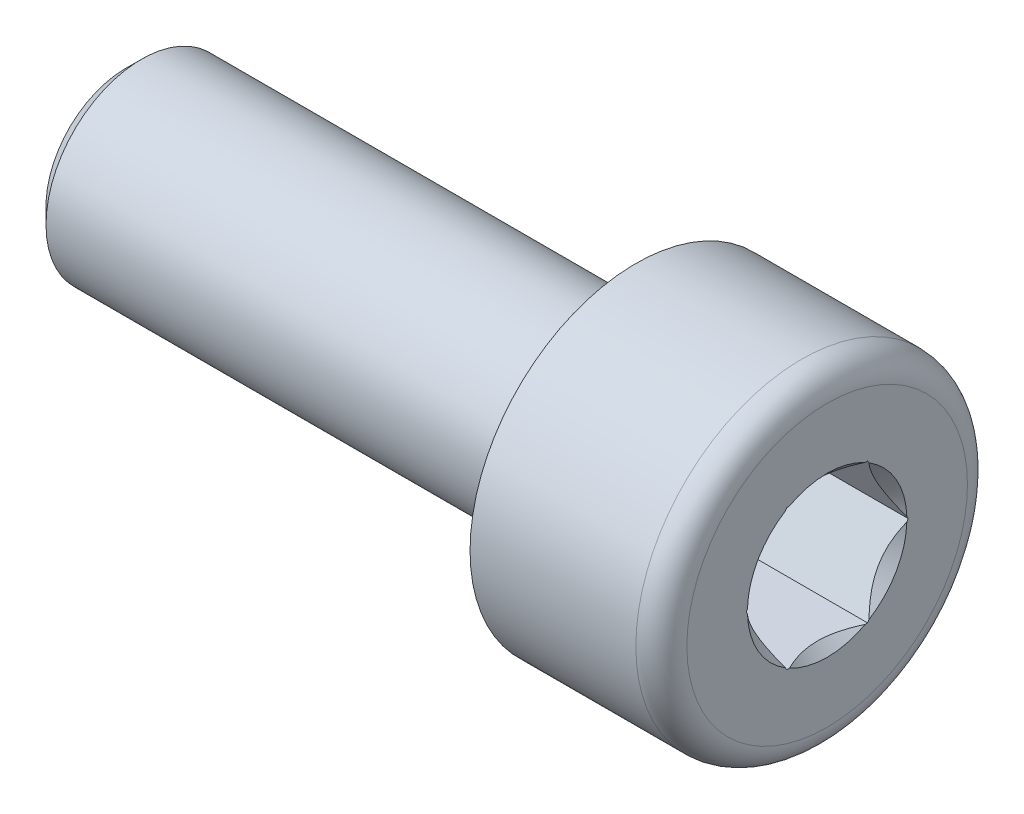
ISO-10303-21;
HEADER;
FILE_DESCRIPTION(('STEP AP214'),'2;1');
FILE_NAME('part.step','',(''),(''),'','','');
FILE_SCHEMA(('AUTOMOTIVE_DESIGN { 1 0 10303 214 1 1 1 1 }'));
ENDSEC;
DATA;
#1=APPLICATION_CONTEXT('core data for automotive mechanical design processes');
#2=APPLICATION_PROTOCOL_DEFINITION('international standard','automotive_design',2000,#1);
#3=PRODUCT_CONTEXT('',#1,'mechanical');
#4=PRODUCT('Part','Part','',(#3));
#5=PRODUCT_RELATED_PRODUCT_CATEGORY('part','',(#4));
#6=PRODUCT_DEFINITION_FORMATION('','',#4);
#7=PRODUCT_DEFINITION_CONTEXT('part definition',#1,'design');
#8=PRODUCT_DEFINITION('design','',#6,#7);
#9=PRODUCT_DEFINITION_SHAPE('','',#8);
#10=(LENGTH_UNIT() NAMED_UNIT(*) SI_UNIT(.MILLI.,.METRE.));
#11=(NAMED_UNIT(*) PLANE_ANGLE_UNIT() SI_UNIT($,.RADIAN.));
#12=(NAMED_UNIT(*) SI_UNIT($,.STERADIAN.) SOLID_ANGLE_UNIT());
#13=UNCERTAINTY_MEASURE_WITH_UNIT(LENGTH_MEASURE(1.E-05),#10,'distance_accuracy_value','');
#14=(GEOMETRIC_REPRESENTATION_CONTEXT(3) GLOBAL_UNCERTAINTY_ASSIGNED_CONTEXT((#13)) GLOBAL_UNIT_ASSIGNED_CONTEXT((#10,
#11,#12)) REPRESENTATION_CONTEXT('',''));
#15=CARTESIAN_POINT('',(0.,0.,0.));
#16=DIRECTION('',(0.,0.,1.));
#17=DIRECTION('',(1.,0.,0.));
#18=AXIS2_PLACEMENT_3D('',#15,#16,#17);
#19=CARTESIAN_POINT('',(2.75,0.,0.));
#20=DIRECTION('',(1.,0.,0.));
#21=DIRECTION('',(0.,0.,-1.));
#22=AXIS2_PLACEMENT_3D('',#19,#20,#21);
#23=CONICAL_SURFACE('',#22,1.,0.785398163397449);
#24=CARTESIAN_POINT('',(3.,0.,0.));
#25=DIRECTION('',(-1.,0.,0.));
#26=DIRECTION('',(0.,0.,1.));
#27=AXIS2_PLACEMENT_3D('',#24,#25,#26);
#28=CIRCLE('',#27,1.25);
#29=CARTESIAN_POINT('',(3.,0.0358259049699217,1.24948649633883));
#30=VERTEX_POINT('',#29);
#31=CARTESIAN_POINT('',(3.,1.06417409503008,0.655769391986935));
#32=VERTEX_POINT('',#31);
#33=EDGE_CURVE('E564',#30,#32,#28,.T.);
#34=ORIENTED_EDGE('',*,*,#33,.F.);
#35=CARTESIAN_POINT('',(3.0002,0.0354613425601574,1.24969697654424));
#36=CARTESIAN_POINT('',(2.98057106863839,0.0712525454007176,1.22903291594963));
#37=CARTESIAN_POINT('',(2.96218791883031,0.107621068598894,1.20803553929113));
#38=CARTESIAN_POINT('',(2.92869924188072,0.181665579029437,1.16528592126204));
#39=CARTESIAN_POINT('',(2.9136099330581,0.219347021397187,1.14353053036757));
#40=CARTESIAN_POINT('',(2.8878781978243,0.295301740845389,1.09967805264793));
#41=CARTESIAN_POINT('',(2.87717776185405,0.333559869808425,1.07758971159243));
#42=CARTESIAN_POINT('',(2.86081733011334,0.410818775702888,1.03298426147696));
#43=CARTESIAN_POINT('',(2.85514691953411,0.449817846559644,1.01046813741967));
#44=CARTESIAN_POINT('',(2.8500562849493,0.518738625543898,0.970676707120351));
#45=CARTESIAN_POINT('',(2.84946433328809,0.548597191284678,0.953437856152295));
#46=CARTESIAN_POINT('',(2.85151417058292,0.608233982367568,0.919006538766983));
#47=CARTESIAN_POINT('',(2.85415683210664,0.638012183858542,0.901814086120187));
#48=CARTESIAN_POINT('',(2.86675061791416,0.726876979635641,0.850507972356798));
#49=CARTESIAN_POINT('',(2.8813674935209,0.785494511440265,0.816665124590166));
#50=CARTESIAN_POINT('',(2.91371510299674,0.880953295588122,0.761551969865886));
#51=CARTESIAN_POINT('',(2.92877855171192,0.918533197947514,0.739855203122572));
#52=CARTESIAN_POINT('',(2.9622229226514,0.992432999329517,0.697189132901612));
#53=CARTESIAN_POINT('',(2.98059247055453,1.0287567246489,0.676217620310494));
#54=CARTESIAN_POINT('',(3.00020000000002,1.06453865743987,0.655558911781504));
#55=B_SPLINE_CURVE_WITH_KNOTS('',3,(#35,#36,#37,#38,#39,#40,#41,#42,#43,#44,#45,#46,#47,#48,#49,
#50,#51,#52,#53,#54),.UNSPECIFIED.,.F.,.F.,(4,2,2,2,2,2,2,2,2,4),(0.,0.137339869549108,
0.275341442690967,0.411455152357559,0.547286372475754,0.650583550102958,0.7539085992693,
0.960556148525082,1.09823708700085,1.23545309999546),.UNSPECIFIED.);
#56=EDGE_CURVE('E535',#30,#32,#55,.T.);
#57=ORIENTED_EDGE('',*,*,#56,.T.);
#58=EDGE_LOOP('',(#34,#57));
#59=FACE_BOUND('',#58,.T.);
#60=ADVANCED_FACE('F348',(#59),#23,.F.);
#61=CARTESIAN_POINT('',(3.,1.1,0.593717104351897));
#62=VERTEX_POINT('',#61);
#63=CARTESIAN_POINT('',(3.,1.1,-0.593717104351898));
#64=VERTEX_POINT('',#63);
#65=EDGE_CURVE('E567',#62,#64,#28,.T.);
#66=ORIENTED_EDGE('',*,*,#65,.F.);
#67=CARTESIAN_POINT('',(3.43571423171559,1.1,-1.27735369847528));
#68=CARTESIAN_POINT('',(3.41218595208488,1.1,-1.24629889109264));
#69=CARTESIAN_POINT('',(3.38888516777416,1.1,-1.2150722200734));
#70=CARTESIAN_POINT('',(3.34283288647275,1.1,-1.1522050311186));
#71=CARTESIAN_POINT('',(3.32008152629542,1.1,-1.12056441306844));
#72=CARTESIAN_POINT('',(3.2524682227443,1.1,-1.02445312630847));
#73=CARTESIAN_POINT('',(3.20860927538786,1.1,-0.959265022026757));
#74=CARTESIAN_POINT('',(3.12241005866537,1.1,-0.822498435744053));
#75=CARTESIAN_POINT('',(3.08030683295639,1.1,-0.750768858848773));
#76=CARTESIAN_POINT('',(3.00322214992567,1.1,-0.60371335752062));
#77=CARTESIAN_POINT('',(2.96821667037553,1.1,-0.52840066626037));
#78=CARTESIAN_POINT('',(2.92538751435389,1.1,-0.415458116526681));
#79=CARTESIAN_POINT('',(2.91311338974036,1.1,-0.379523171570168));
#80=CARTESIAN_POINT('',(2.89144883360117,1.1,-0.306776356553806));
#81=CARTESIAN_POINT('',(2.8820585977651,1.1,-0.269964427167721));
#82=CARTESIAN_POINT('',(2.86681026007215,1.1,-0.196309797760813));
#83=CARTESIAN_POINT('',(2.8608904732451,1.1,-0.15948007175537));
#84=CARTESIAN_POINT('',(2.85269658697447,1.1,-0.0854029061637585));
#85=CARTESIAN_POINT('',(2.85042301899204,1.1,-0.0481554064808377));
#86=CARTESIAN_POINT('',(2.84969862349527,1.1,0.0249787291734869));
#87=CARTESIAN_POINT('',(2.8511076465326,1.1,0.0608640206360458));
#88=CARTESIAN_POINT('',(2.85735793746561,1.1,0.132320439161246));
#89=CARTESIAN_POINT('',(2.86219840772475,1.1,0.167891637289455));
#90=CARTESIAN_POINT('',(2.87512760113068,1.1,0.239082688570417));
#91=CARTESIAN_POINT('',(2.8832724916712,1.1,0.274692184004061));
#92=CARTESIAN_POINT('',(2.90237439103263,1.1,0.345131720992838));
#93=CARTESIAN_POINT('',(2.91333117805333,1.1,0.379961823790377));
#94=CARTESIAN_POINT('',(2.95180952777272,1.1,0.489135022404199));
#95=CARTESIAN_POINT('',(2.98369310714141,1.1,0.561936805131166));
#96=CARTESIAN_POINT('',(3.05459595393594,1.1,0.704124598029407));
#97=CARTESIAN_POINT('',(3.09364075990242,1.1,0.773497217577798));
#98=CARTESIAN_POINT('',(3.17420835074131,1.1,0.90608520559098));
#99=CARTESIAN_POINT('',(3.21551216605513,1.1,0.969435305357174));
#100=CARTESIAN_POINT('',(3.2793699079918,1.1,1.06276872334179));
#101=CARTESIAN_POINT('',(3.30088220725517,1.1,1.09347730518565));
#102=CARTESIAN_POINT('',(3.34447743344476,1.1,1.15447448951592));
#103=CARTESIAN_POINT('',(3.36656020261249,1.1,1.18476320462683));
#104=CARTESIAN_POINT('',(3.38887955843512,1.1,1.21487703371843));
#105=B_SPLINE_CURVE_WITH_KNOTS('',3,(#67,#68,#69,#70,#71,#72,#73,#74,#75,#76,#77,#78,#79,#80,
#81,#82,#83,#84,#85,#86,#87,#88,#89,#90,#91,#92,#93,#94,#95,#96,#97,#98,#99,#100,#101,#102,#103,
#104),.UNSPECIFIED.,.F.,.F.,(4,2,2,2,2,2,2,2,2,2,2,2,2,2,2,2,2,2,4),(0.,0.116880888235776,
0.233790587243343,0.469393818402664,0.718712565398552,0.967172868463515,1.08099679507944,
1.19482844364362,1.30657013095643,1.41832810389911,1.52589533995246,1.63343758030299,
1.74288995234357,1.85233369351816,2.09006749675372,2.32866620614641,2.5554302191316,
2.66790773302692,2.78035446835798),.UNSPECIFIED.);
#106=EDGE_CURVE('E543',#62,#64,#105,.F.);
#107=ORIENTED_EDGE('',*,*,#106,.T.);
#108=EDGE_LOOP('',(#66,#107));
#109=FACE_BOUND('',#108,.T.);
#110=ADVANCED_FACE('F608',(#109),#23,.F.);
#111=CARTESIAN_POINT('',(3.,1.06417409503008,-0.655769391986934));
#112=VERTEX_POINT('',#111);
#113=CARTESIAN_POINT('',(3.,0.0358259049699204,-1.24948649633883));
#114=VERTEX_POINT('',#113);
#115=EDGE_CURVE('E583',#112,#114,#28,.T.);
#116=ORIENTED_EDGE('',*,*,#115,.F.);
#117=CARTESIAN_POINT('',(3.00020000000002,1.06453865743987,-0.655558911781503));
#118=CARTESIAN_POINT('',(2.9805710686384,1.02874745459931,-0.676222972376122));
#119=CARTESIAN_POINT('',(2.96218791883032,0.992378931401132,-0.69722034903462));
#120=CARTESIAN_POINT('',(2.92869924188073,0.918334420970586,-0.739969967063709));
#121=CARTESIAN_POINT('',(2.91360993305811,0.880652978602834,-0.761725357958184));
#122=CARTESIAN_POINT('',(2.8878781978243,0.804698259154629,-0.805577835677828));
#123=CARTESIAN_POINT('',(2.87717776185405,0.766440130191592,-0.827666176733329));
#124=CARTESIAN_POINT('',(2.86081733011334,0.689181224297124,-0.872271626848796));
#125=CARTESIAN_POINT('',(2.85514691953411,0.650182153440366,-0.894787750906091));
#126=CARTESIAN_POINT('',(2.8500562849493,0.58126137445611,-0.934579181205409));
#127=CARTESIAN_POINT('',(2.84946433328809,0.55140280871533,-0.951818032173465));
#128=CARTESIAN_POINT('',(2.85151417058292,0.49176601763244,-0.986249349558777));
#129=CARTESIAN_POINT('',(2.85415683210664,0.461987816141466,-1.00344180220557));
#130=CARTESIAN_POINT('',(2.86675061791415,0.373123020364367,-1.05474791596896));
#131=CARTESIAN_POINT('',(2.88136749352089,0.314505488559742,-1.08859076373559));
#132=CARTESIAN_POINT('',(2.91371510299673,0.219046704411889,-1.14370391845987));
#133=CARTESIAN_POINT('',(2.92877855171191,0.181466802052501,-1.16540068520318));
#134=CARTESIAN_POINT('',(2.96222292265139,0.107567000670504,-1.20806675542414));
#135=CARTESIAN_POINT('',(2.98059247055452,0.0712432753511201,-1.22903826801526));
#136=CARTESIAN_POINT('',(3.0002,0.0354613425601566,-1.24969697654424));
#137=B_SPLINE_CURVE_WITH_KNOTS('',3,(#117,#118,#119,#120,#121,#122,#123,#124,#125,#126,#127,
#128,#129,#130,#131,#132,#133,#134,#135,#136),.UNSPECIFIED.,.F.,.F.,(4,2,2,2,2,2,2,2,2,4),(0.,
0.137339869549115,0.275341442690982,0.41145515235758,0.547286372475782,0.650583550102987,
0.753908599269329,0.960556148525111,1.09823708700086,1.23545309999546),.UNSPECIFIED.);
#138=EDGE_CURVE('E589',#112,#114,#137,.T.);
#139=ORIENTED_EDGE('',*,*,#138,.T.);
#140=EDGE_LOOP('',(#116,#139));
#141=FACE_BOUND('',#140,.T.);
#142=ADVANCED_FACE('F588',(#141),#23,.F.);
#143=CARTESIAN_POINT('',(3.,-0.0358259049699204,-1.24948649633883));
#144=VERTEX_POINT('',#143);
#145=CARTESIAN_POINT('',(3.,-1.06417409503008,-0.655769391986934));
#146=VERTEX_POINT('',#145);
#147=EDGE_CURVE('E590',#144,#146,#28,.T.);
#148=ORIENTED_EDGE('',*,*,#147,.F.);
#149=CARTESIAN_POINT('',(3.0002,-0.0354613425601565,-1.24969697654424));
#150=CARTESIAN_POINT('',(2.98057106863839,-0.0712525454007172,-1.22903291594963));
#151=CARTESIAN_POINT('',(2.96218791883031,-0.107621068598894,-1.20803553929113));
#152=CARTESIAN_POINT('',(2.92869924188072,-0.181665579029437,-1.16528592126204));
#153=CARTESIAN_POINT('',(2.9136099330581,-0.219347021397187,-1.14353053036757));
#154=CARTESIAN_POINT('',(2.88787819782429,-0.295301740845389,-1.09967805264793));
#155=CARTESIAN_POINT('',(2.87717776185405,-0.333559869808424,-1.07758971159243));
#156=CARTESIAN_POINT('',(2.86081733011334,-0.410818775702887,-1.03298426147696));
#157=CARTESIAN_POINT('',(2.85514691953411,-0.449817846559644,-1.01046813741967));
#158=CARTESIAN_POINT('',(2.8500562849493,-0.518738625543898,-0.97067670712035));
#159=CARTESIAN_POINT('',(2.84946433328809,-0.548597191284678,-0.953437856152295));
#160=CARTESIAN_POINT('',(2.85151417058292,-0.608233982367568,-0.919006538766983));
#161=CARTESIAN_POINT('',(2.85415683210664,-0.638012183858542,-0.901814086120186));
#162=CARTESIAN_POINT('',(2.86675061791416,-0.72687697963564,-0.850507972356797));
#163=CARTESIAN_POINT('',(2.8813674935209,-0.785494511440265,-0.816665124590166));
#164=CARTESIAN_POINT('',(2.91371510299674,-0.880953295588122,-0.761551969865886));
#165=CARTESIAN_POINT('',(2.92877855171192,-0.918533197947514,-0.739855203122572));
#166=CARTESIAN_POINT('',(2.9622229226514,-0.992432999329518,-0.697189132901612));
#167=CARTESIAN_POINT('',(2.98059247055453,-1.02875672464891,-0.676217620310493));
#168=CARTESIAN_POINT('',(3.00020000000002,-1.06453865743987,-0.655558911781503));
#169=B_SPLINE_CURVE_WITH_KNOTS('',3,(#149,#150,#151,#152,#153,#154,#155,#156,#157,#158,#159,
#160,#161,#162,#163,#164,#165,#166,#167,#168),.UNSPECIFIED.,.F.,.F.,(4,2,2,2,2,2,2,2,2,4),(0.,
0.137339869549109,0.275341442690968,0.41145515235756,0.547286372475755,0.650583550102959,
0.753908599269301,0.960556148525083,1.09823708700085,1.23545309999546),.UNSPECIFIED.);
#170=EDGE_CURVE('E620',#144,#146,#169,.T.);
#171=ORIENTED_EDGE('',*,*,#170,.T.);
#172=EDGE_LOOP('',(#148,#171));
#173=FACE_BOUND('',#172,.T.);
#174=ADVANCED_FACE('F611',(#173),#23,.F.);
#175=CARTESIAN_POINT('',(3.,-1.1,-0.593717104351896));
#176=VERTEX_POINT('',#175);
#177=CARTESIAN_POINT('',(3.,-1.1,0.593717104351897));
#178=VERTEX_POINT('',#177);
#179=EDGE_CURVE('E463',#176,#178,#28,.T.);
#180=ORIENTED_EDGE('',*,*,#179,.F.);
#181=CARTESIAN_POINT('',(3.43571423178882,-1.1,-1.27735369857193));
#182=CARTESIAN_POINT('',(3.41218595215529,-1.1,-1.24629889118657));
#183=CARTESIAN_POINT('',(3.38888516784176,-1.1,-1.21507222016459));
#184=CARTESIAN_POINT('',(3.34283288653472,-1.1,-1.15220503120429));
#185=CARTESIAN_POINT('',(3.32008152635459,-1.1,-1.12056441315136));
#186=CARTESIAN_POINT('',(3.25246822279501,-1.1,-1.02445312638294));
#187=CARTESIAN_POINT('',(3.20860927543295,-1.1,-0.95926502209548));
#188=CARTESIAN_POINT('',(3.1224100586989,-1.1,-0.822498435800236));
#189=CARTESIAN_POINT('',(3.08030683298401,-1.1,-0.750768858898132));
#190=CARTESIAN_POINT('',(3.00322214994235,-1.1,-0.603713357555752));
#191=CARTESIAN_POINT('',(2.96821667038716,-1.1,-0.528400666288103));
#192=CARTESIAN_POINT('',(2.92538751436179,-1.1,-0.415458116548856));
#193=CARTESIAN_POINT('',(2.91311338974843,-1.1,-0.379523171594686));
#194=CARTESIAN_POINT('',(2.89144883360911,-1.1,-0.30677635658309));
#195=CARTESIAN_POINT('',(2.88205859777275,-1.1,-0.269964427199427));
#196=CARTESIAN_POINT('',(2.86681026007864,-1.1,-0.196309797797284));
#197=CARTESIAN_POINT('',(2.86089047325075,-1.1,-0.159480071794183));
#198=CARTESIAN_POINT('',(2.85269658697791,-1.1,-0.0854029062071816));
#199=CARTESIAN_POINT('',(2.85042301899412,-1.1,-0.0481554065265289));
#200=CARTESIAN_POINT('',(2.8496986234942,-1.1,0.0249787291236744));
#201=CARTESIAN_POINT('',(2.8511076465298,-1.1,0.060864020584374));
#202=CARTESIAN_POINT('',(2.85735793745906,-1.1,0.132320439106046));
#203=CARTESIAN_POINT('',(2.86219840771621,-1.1,0.167891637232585));
#204=CARTESIAN_POINT('',(2.87512760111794,-1.1,0.239082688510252));
#205=CARTESIAN_POINT('',(2.88327249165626,-1.1,0.274692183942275));
#206=CARTESIAN_POINT('',(2.90237439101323,-1.1,0.34513172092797));
#207=CARTESIAN_POINT('',(2.91333117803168,-1.1,0.379961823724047));
#208=CARTESIAN_POINT('',(2.9518095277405,-1.1,0.489135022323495));
#209=CARTESIAN_POINT('',(2.98369310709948,-1.1,0.561936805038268));
#210=CARTESIAN_POINT('',(3.0545959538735,-1.1,0.70412459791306));
#211=CARTESIAN_POINT('',(3.09364075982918,-1.1,0.7734972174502));
#212=CARTESIAN_POINT('',(3.17420835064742,-1.1,0.90608520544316));
#213=CARTESIAN_POINT('',(3.21551216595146,-1.1,0.969435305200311));
#214=CARTESIAN_POINT('',(3.27936990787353,-1.1,1.06276872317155));
#215=CARTESIAN_POINT('',(3.30088220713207,-1.1,1.09347730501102));
#216=CARTESIAN_POINT('',(3.344477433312,-1.1,1.15447448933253));
#217=CARTESIAN_POINT('',(3.3665602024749,-1.1,1.18476320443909));
#218=CARTESIAN_POINT('',(3.38887955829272,-1.1,1.21487703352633));
#219=B_SPLINE_CURVE_WITH_KNOTS('',3,(#181,#182,#183,#184,#185,#186,#187,#188,#189,#190,#191,
#192,#193,#194,#195,#196,#197,#198,#199,#200,#201,#202,#203,#204,#205,#206,#207,#208,#209,#210,
#211,#212,#213,#214,#215,#216,#217,#218),.UNSPECIFIED.,.F.,.F.,(4,2,2,2,2,2,2,2,2,2,2,2,2,2,2,2,
2,2,4),(0.,0.116880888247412,0.233790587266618,0.469393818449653,0.71871256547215,
0.96717286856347,1.0809967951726,1.19482844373,1.30657013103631,1.41832810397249,
1.52589534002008,1.63343758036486,1.74288995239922,1.85233369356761,2.09006749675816,
2.32866620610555,2.555430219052,2.66790773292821,2.78035446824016),.UNSPECIFIED.);
#220=EDGE_CURVE('E509',#176,#178,#219,.T.);
#221=ORIENTED_EDGE('',*,*,#220,.T.);
#222=EDGE_LOOP('',(#180,#221));
#223=FACE_BOUND('',#222,.T.);
#224=ADVANCED_FACE('F598',(#223),#23,.F.);
#225=CARTESIAN_POINT('',(-30.,0.,0.));
#226=DIRECTION('',(-1.,0.,0.));
#227=DIRECTION('',(0.,0.,1.));
#228=AXIS2_PLACEMENT_3D('',#225,#226,#227);
#229=CYLINDRICAL_SURFACE('',#228,1.5);
#230=CARTESIAN_POINT('',(-7.75,0.,0.));
#231=DIRECTION('',(1.,0.,0.));
#232=DIRECTION('',(0.,0.,-1.));
#233=AXIS2_PLACEMENT_3D('',#230,#231,#232);
#234=CIRCLE('',#233,1.5);
#235=CARTESIAN_POINT('',(-7.75,0.,-1.5));
#236=VERTEX_POINT('',#235);
#237=EDGE_CURVE('E570',#236,#236,#234,.T.);
#238=ORIENTED_EDGE('',*,*,#237,.T.);
#239=EDGE_LOOP('',(#238));
#240=FACE_BOUND('',#239,.T.);
#241=CARTESIAN_POINT('',(0.,0.,0.));
#242=DIRECTION('',(-1.,0.,0.));
#243=DIRECTION('',(0.,0.,1.));
#244=AXIS2_PLACEMENT_3D('',#241,#242,#243);
#245=CIRCLE('',#244,1.5);
#246=CARTESIAN_POINT('',(0.,0.,1.5));
#247=VERTEX_POINT('',#246);
#248=EDGE_CURVE('E551',#247,#247,#245,.T.);
#249=ORIENTED_EDGE('',*,*,#248,.T.);
#250=EDGE_LOOP('',(#249));
#251=FACE_BOUND('',#250,.T.);
#252=ADVANCED_FACE('F350',(#240,#251),#229,.T.);
#253=CARTESIAN_POINT('',(-8.,0.,0.));
#254=DIRECTION('',(1.,0.,0.));
#255=DIRECTION('',(0.,0.,-1.));
#256=AXIS2_PLACEMENT_3D('',#253,#254,#255);
#257=PLANE('',#256);
#258=CARTESIAN_POINT('',(-8.,0.,0.));
#259=DIRECTION('',(1.,0.,0.));
#260=DIRECTION('',(0.,0.,-1.));
#261=AXIS2_PLACEMENT_3D('',#258,#259,#260);
#262=CIRCLE('',#261,1.25);
#263=CARTESIAN_POINT('',(-8.,0.,-1.25));
#264=VERTEX_POINT('',#263);
#265=EDGE_CURVE('E566',#264,#264,#262,.F.);
#266=ORIENTED_EDGE('',*,*,#265,.T.);
#267=EDGE_LOOP('',(#266));
#268=FACE_BOUND('',#267,.T.);
#269=ADVANCED_FACE('F597',(#268),#257,.F.);
#270=CARTESIAN_POINT('',(3.,-1.06417409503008,0.655769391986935));
#271=VERTEX_POINT('',#270);
#272=CARTESIAN_POINT('',(3.,-0.035825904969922,1.24948649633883));
#273=VERTEX_POINT('',#272);
#274=EDGE_CURVE('E563',#271,#273,#28,.T.);
#275=ORIENTED_EDGE('',*,*,#274,.F.);
#276=CARTESIAN_POINT('',(3.00020000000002,-1.06453865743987,0.655558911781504));
#277=CARTESIAN_POINT('',(2.9805710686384,-1.02874745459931,0.676222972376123));
#278=CARTESIAN_POINT('',(2.96218791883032,-0.992378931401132,0.69722034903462));
#279=CARTESIAN_POINT('',(2.92869924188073,-0.918334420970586,0.73996996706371));
#280=CARTESIAN_POINT('',(2.91360993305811,-0.880652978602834,0.761725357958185));
#281=CARTESIAN_POINT('',(2.8878781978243,-0.804698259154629,0.805577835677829));
#282=CARTESIAN_POINT('',(2.87717776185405,-0.766440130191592,0.82766617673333));
#283=CARTESIAN_POINT('',(2.86081733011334,-0.689181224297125,0.872271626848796));
#284=CARTESIAN_POINT('',(2.85514691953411,-0.650182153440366,0.894787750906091));
#285=CARTESIAN_POINT('',(2.8500562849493,-0.58126137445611,0.93457918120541));
#286=CARTESIAN_POINT('',(2.8494643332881,-0.55140280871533,0.951818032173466));
#287=CARTESIAN_POINT('',(2.85151417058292,-0.49176601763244,0.986249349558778));
#288=CARTESIAN_POINT('',(2.85415683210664,-0.461987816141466,1.00344180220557));
#289=CARTESIAN_POINT('',(2.86675061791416,-0.373123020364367,1.05474791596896));
#290=CARTESIAN_POINT('',(2.88136749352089,-0.314505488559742,1.08859076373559));
#291=CARTESIAN_POINT('',(2.91371510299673,-0.219046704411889,1.14370391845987));
#292=CARTESIAN_POINT('',(2.92877855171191,-0.181466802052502,1.16540068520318));
#293=CARTESIAN_POINT('',(2.96222292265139,-0.107567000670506,1.20806675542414));
#294=CARTESIAN_POINT('',(2.98059247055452,-0.0712432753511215,1.22903826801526));
#295=CARTESIAN_POINT('',(3.0002,-0.0354613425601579,1.24969697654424));
#296=B_SPLINE_CURVE_WITH_KNOTS('',3,(#276,#277,#278,#279,#280,#281,#282,#283,#284,#285,#286,
#287,#288,#289,#290,#291,#292,#293,#294,#295),.UNSPECIFIED.,.F.,.F.,(4,2,2,2,2,2,2,2,2,4),(0.,
0.137339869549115,0.275341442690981,0.41145515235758,0.547286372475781,0.650583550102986,
0.753908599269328,0.96055614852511,1.09823708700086,1.23545309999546),.UNSPECIFIED.);
#297=EDGE_CURVE('E441',#271,#273,#296,.T.);
#298=ORIENTED_EDGE('',*,*,#297,.T.);
#299=EDGE_LOOP('',(#275,#298));
#300=FACE_BOUND('',#299,.T.);
#301=ADVANCED_FACE('F515',(#300),#23,.F.);
#302=CARTESIAN_POINT('',(3.,2.2,0.));
#303=DIRECTION('',(-1.,0.,0.));
#304=DIRECTION('',(0.,0.,1.));
#305=AXIS2_PLACEMENT_3D('',#302,#303,#304);
#306=PLANE('',#305);
#307=CARTESIAN_POINT('',(3.,0.,0.));
#308=DIRECTION('',(-1.,0.,0.));
#309=DIRECTION('',(0.,0.,1.));
#310=AXIS2_PLACEMENT_3D('',#307,#308,#309);
#311=CIRCLE('',#310,2.2);
#312=CARTESIAN_POINT('',(3.,0.,2.2));
#313=VERTEX_POINT('',#312);
#314=EDGE_CURVE('E560',#313,#313,#311,.T.);
#315=ORIENTED_EDGE('',*,*,#314,.F.);
#316=EDGE_LOOP('',(#315));
#317=FACE_BOUND('',#316,.T.);
#318=ORIENTED_EDGE('',*,*,#33,.T.);
#319=DIRECTION('',(0.,-0.866025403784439,0.5));
#320=VECTOR('',#319,1.);
#321=CARTESIAN_POINT('',(3.,1.1,0.635085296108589));
#322=LINE('',#321,#320);
#323=CARTESIAN_POINT('',(3.,1.1,0.635085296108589));
#324=VERTEX_POINT('',#323);
#325=EDGE_CURVE('E469',#324,#32,#322,.T.);
#326=ORIENTED_EDGE('',*,*,#325,.F.);
#327=DIRECTION('',(0.,0.,-1.));
#328=VECTOR('',#327,1.);
#329=CARTESIAN_POINT('',(3.,1.1,0.));
#330=LINE('',#329,#328);
#331=EDGE_CURVE('E11',#324,#62,#330,.T.);
#332=ORIENTED_EDGE('',*,*,#331,.T.);
#333=ORIENTED_EDGE('',*,*,#65,.T.);
#334=DIRECTION('',(0.,0.,1.));
#335=VECTOR('',#334,1.);
#336=CARTESIAN_POINT('',(3.,1.1,-0.635085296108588));
#337=LINE('',#336,#335);
#338=CARTESIAN_POINT('',(3.,1.1,-0.635085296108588));
#339=VERTEX_POINT('',#338);
#340=EDGE_CURVE('E474',#339,#64,#337,.T.);
#341=ORIENTED_EDGE('',*,*,#340,.F.);
#342=DIRECTION('',(0.,-0.866025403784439,-0.5));
#343=VECTOR('',#342,1.);
#344=CARTESIAN_POINT('',(3.,2.2,0.));
#345=LINE('',#344,#343);
#346=EDGE_CURVE('E356',#339,#112,#345,.T.);
#347=ORIENTED_EDGE('',*,*,#346,.T.);
#348=ORIENTED_EDGE('',*,*,#115,.T.);
#349=DIRECTION('',(0.,0.866025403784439,0.5));
#350=VECTOR('',#349,1.);
#351=CARTESIAN_POINT('',(3.,0.,-1.27017059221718));
#352=LINE('',#351,#350);
#353=CARTESIAN_POINT('',(3.,0.,-1.27017059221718));
#354=VERTEX_POINT('',#353);
#355=EDGE_CURVE('E467',#354,#114,#352,.T.);
#356=ORIENTED_EDGE('',*,*,#355,.F.);
#357=DIRECTION('',(0.,-0.866025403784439,0.5));
#358=VECTOR('',#357,1.);
#359=CARTESIAN_POINT('',(3.,1.1,-1.90525588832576));
#360=LINE('',#359,#358);
#361=EDGE_CURVE('E576',#354,#144,#360,.T.);
#362=ORIENTED_EDGE('',*,*,#361,.T.);
#363=ORIENTED_EDGE('',*,*,#147,.T.);
#364=DIRECTION('',(0.,0.866025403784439,-0.5));
#365=VECTOR('',#364,1.);
#366=CARTESIAN_POINT('',(3.,-1.1,-0.635085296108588));
#367=LINE('',#366,#365);
#368=CARTESIAN_POINT('',(3.,-1.1,-0.635085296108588));
#369=VERTEX_POINT('',#368);
#370=EDGE_CURVE('E464',#369,#146,#367,.T.);
#371=ORIENTED_EDGE('',*,*,#370,.F.);
#372=DIRECTION('',(0.,0.,1.));
#373=VECTOR('',#372,1.);
#374=CARTESIAN_POINT('',(3.,-1.1,0.));
#375=LINE('',#374,#373);
#376=EDGE_CURVE('E446',#369,#176,#375,.T.);
#377=ORIENTED_EDGE('',*,*,#376,.T.);
#378=ORIENTED_EDGE('',*,*,#179,.T.);
#379=DIRECTION('',(0.,0.,-1.));
#380=VECTOR('',#379,1.);
#381=CARTESIAN_POINT('',(3.,-1.1,0.635085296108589));
#382=LINE('',#381,#380);
#383=CARTESIAN_POINT('',(3.,-1.1,0.635085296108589));
#384=VERTEX_POINT('',#383);
#385=EDGE_CURVE('E451',#384,#178,#382,.T.);
#386=ORIENTED_EDGE('',*,*,#385,.F.);
#387=DIRECTION('',(0.,0.866025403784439,0.5));
#388=VECTOR('',#387,1.);
#389=CARTESIAN_POINT('',(3.,1.1,1.90525588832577));
#390=LINE('',#389,#388);
#391=EDGE_CURVE('E435',#384,#271,#390,.T.);
#392=ORIENTED_EDGE('',*,*,#391,.T.);
#393=ORIENTED_EDGE('',*,*,#274,.T.);
#394=DIRECTION('',(0.,-0.866025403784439,-0.5));
#395=VECTOR('',#394,1.);
#396=CARTESIAN_POINT('',(3.,0.,1.27017059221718));
#397=LINE('',#396,#395);
#398=CARTESIAN_POINT('',(3.,0.,1.27017059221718));
#399=VERTEX_POINT('',#398);
#400=EDGE_CURVE('E465',#399,#273,#397,.T.);
#401=ORIENTED_EDGE('',*,*,#400,.F.);
#402=DIRECTION('',(0.,0.866025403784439,-0.5));
#403=VECTOR('',#402,1.);
#404=CARTESIAN_POINT('',(3.,2.2,0.));
#405=LINE('',#404,#403);
#406=EDGE_CURVE('E447',#399,#30,#405,.T.);
#407=ORIENTED_EDGE('',*,*,#406,.T.);
#408=EDGE_LOOP('',(#318,#326,#332,#333,#341,#347,#348,#356,#362,#363,#371,#377,#378,#386,#392,
#393,#401,#407));
#409=FACE_BOUND('',#408,.T.);
#410=ADVANCED_FACE('F460',(#317,#409),#306,.F.);
#411=CARTESIAN_POINT('',(2.6,0.,0.));
#412=DIRECTION('',(-1.,0.,0.));
#413=DIRECTION('',(0.,0.,1.));
#414=AXIS2_PLACEMENT_3D('',#411,#412,#413);
#415=TOROIDAL_SURFACE('',#414,2.2,0.4);
#416=CARTESIAN_POINT('',(2.6,0.,0.));
#417=DIRECTION('',(-1.,0.,0.));
#418=DIRECTION('',(0.,0.,1.));
#419=AXIS2_PLACEMENT_3D('',#416,#417,#418);
#420=CIRCLE('',#419,2.6);
#421=CARTESIAN_POINT('',(2.6,0.,2.6));
#422=VERTEX_POINT('',#421);
#423=EDGE_CURVE('E557',#422,#422,#420,.T.);
#424=ORIENTED_EDGE('',*,*,#423,.F.);
#425=EDGE_LOOP('',(#424));
#426=FACE_BOUND('',#425,.T.);
#427=ORIENTED_EDGE('',*,*,#314,.T.);
#428=EDGE_LOOP('',(#427));
#429=FACE_BOUND('',#428,.T.);
#430=ADVANCED_FACE('F603',(#426,#429),#415,.T.);
#431=CARTESIAN_POINT('',(-30.,0.,0.));
#432=DIRECTION('',(-1.,0.,0.));
#433=DIRECTION('',(0.,0.,1.));
#434=AXIS2_PLACEMENT_3D('',#431,#432,#433);
#435=CYLINDRICAL_SURFACE('',#434,2.6);
#436=CARTESIAN_POINT('',(0.,0.,0.));
#437=DIRECTION('',(-1.,0.,0.));
#438=DIRECTION('',(0.,0.,1.));
#439=AXIS2_PLACEMENT_3D('',#436,#437,#438);
#440=CIRCLE('',#439,2.6);
#441=CARTESIAN_POINT('',(0.,0.,2.6));
#442=VERTEX_POINT('',#441);
#443=EDGE_CURVE('E554',#442,#442,#440,.T.);
#444=ORIENTED_EDGE('',*,*,#443,.F.);
#445=EDGE_LOOP('',(#444));
#446=FACE_BOUND('',#445,.T.);
#447=ORIENTED_EDGE('',*,*,#423,.T.);
#448=EDGE_LOOP('',(#447));
#449=FACE_BOUND('',#448,.T.);
#450=ADVANCED_FACE('F677',(#446,#449),#435,.T.);
#451=CARTESIAN_POINT('',(0.,1.5,0.));
#452=DIRECTION('',(1.,0.,0.));
#453=DIRECTION('',(0.,0.,-1.));
#454=AXIS2_PLACEMENT_3D('',#451,#452,#453);
#455=PLANE('',#454);
#456=ORIENTED_EDGE('',*,*,#248,.F.);
#457=EDGE_LOOP('',(#456));
#458=FACE_BOUND('',#457,.T.);
#459=ORIENTED_EDGE('',*,*,#443,.T.);
#460=EDGE_LOOP('',(#459));
#461=FACE_BOUND('',#460,.T.);
#462=ADVANCED_FACE('F644',(#458,#461),#455,.F.);
#463=CARTESIAN_POINT('',(-8.,0.,0.));
#464=DIRECTION('',(1.,0.,0.));
#465=DIRECTION('',(0.,0.,-1.));
#466=AXIS2_PLACEMENT_3D('',#463,#464,#465);
#467=CONICAL_SURFACE('',#466,1.25,0.785398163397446);
#468=ORIENTED_EDGE('',*,*,#237,.F.);
#469=EDGE_LOOP('',(#468));
#470=FACE_BOUND('',#469,.T.);
#471=ORIENTED_EDGE('',*,*,#265,.F.);
#472=EDGE_LOOP('',(#471));
#473=FACE_BOUND('',#472,.T.);
#474=ADVANCED_FACE('F532',(#470,#473),#467,.T.);
#475=CARTESIAN_POINT('',(1.,1.1,0.635085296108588));
#476=DIRECTION('',(-1.,0.,0.));
#477=DIRECTION('',(0.,0.,1.));
#478=AXIS2_PLACEMENT_3D('',#475,#476,#477);
#479=PLANE('',#478);
#480=DIRECTION('',(0.,-0.866025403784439,0.5));
#481=VECTOR('',#480,1.);
#482=CARTESIAN_POINT('',(1.,1.1,0.635085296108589));
#483=LINE('',#482,#481);
#484=CARTESIAN_POINT('',(1.,1.1,0.635085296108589));
#485=VERTEX_POINT('',#484);
#486=CARTESIAN_POINT('',(1.,0.,1.27017059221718));
#487=VERTEX_POINT('',#486);
#488=EDGE_CURVE('E476',#485,#487,#483,.T.);
#489=ORIENTED_EDGE('',*,*,#488,.T.);
#490=DIRECTION('',(0.,-0.866025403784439,-0.5));
#491=VECTOR('',#490,1.);
#492=CARTESIAN_POINT('',(1.,0.,1.27017059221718));
#493=LINE('',#492,#491);
#494=CARTESIAN_POINT('',(1.,-1.1,0.635085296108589));
#495=VERTEX_POINT('',#494);
#496=EDGE_CURVE('E479',#487,#495,#493,.T.);
#497=ORIENTED_EDGE('',*,*,#496,.T.);
#498=DIRECTION('',(0.,0.,-1.));
#499=VECTOR('',#498,1.);
#500=CARTESIAN_POINT('',(1.,-1.1,0.635085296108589));
#501=LINE('',#500,#499);
#502=CARTESIAN_POINT('',(1.,-1.1,-0.635085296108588));
#503=VERTEX_POINT('',#502);
#504=EDGE_CURVE('E454',#495,#503,#501,.T.);
#505=ORIENTED_EDGE('',*,*,#504,.T.);
#506=DIRECTION('',(0.,0.866025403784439,-0.5));
#507=VECTOR('',#506,1.);
#508=CARTESIAN_POINT('',(1.,-1.1,-0.635085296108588));
#509=LINE('',#508,#507);
#510=CARTESIAN_POINT('',(1.,0.,-1.27017059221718));
#511=VERTEX_POINT('',#510);
#512=EDGE_CURVE('E482',#503,#511,#509,.T.);
#513=ORIENTED_EDGE('',*,*,#512,.T.);
#514=DIRECTION('',(0.,0.866025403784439,0.5));
#515=VECTOR('',#514,1.);
#516=CARTESIAN_POINT('',(1.,0.,-1.27017059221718));
#517=LINE('',#516,#515);
#518=CARTESIAN_POINT('',(1.,1.1,-0.635085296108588));
#519=VERTEX_POINT('',#518);
#520=EDGE_CURVE('E485',#511,#519,#517,.T.);
#521=ORIENTED_EDGE('',*,*,#520,.T.);
#522=DIRECTION('',(0.,0.,1.));
#523=VECTOR('',#522,1.);
#524=CARTESIAN_POINT('',(1.,1.1,-0.635085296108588));
#525=LINE('',#524,#523);
#526=EDGE_CURVE('E488',#519,#485,#525,.T.);
#527=ORIENTED_EDGE('',*,*,#526,.T.);
#528=EDGE_LOOP('',(#489,#497,#505,#513,#521,#527));
#529=FACE_BOUND('',#528,.T.);
#530=CARTESIAN_POINT('',(1.,0.,0.));
#531=DIRECTION('',(-1.,0.,0.));
#532=DIRECTION('',(0.,0.,1.));
#533=AXIS2_PLACEMENT_3D('',#530,#531,#532);
#534=CIRCLE('',#533,1.);
#535=CARTESIAN_POINT('',(1.,0.,1.));
#536=VERTEX_POINT('',#535);
#537=EDGE_CURVE('E542',#536,#536,#534,.F.);
#538=ORIENTED_EDGE('',*,*,#537,.F.);
#539=EDGE_LOOP('',(#538));
#540=FACE_BOUND('',#539,.T.);
#541=ADVANCED_FACE('F530',(#529,#540),#479,.F.);
#542=CARTESIAN_POINT('',(1.,1.1,0.635085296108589));
#543=DIRECTION('',(0.,0.5,0.866025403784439));
#544=DIRECTION('',(0.,-0.866025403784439,0.5));
#545=AXIS2_PLACEMENT_3D('',#542,#543,#544);
#546=PLANE('',#545);
#547=ORIENTED_EDGE('',*,*,#406,.F.);
#548=DIRECTION('',(1.,0.,0.));
#549=VECTOR('',#548,1.);
#550=CARTESIAN_POINT('',(1.,0.,1.27017059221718));
#551=LINE('',#550,#549);
#552=EDGE_CURVE('E363',#487,#399,#551,.T.);
#553=ORIENTED_EDGE('',*,*,#552,.F.);
#554=ORIENTED_EDGE('',*,*,#488,.F.);
#555=DIRECTION('',(1.,0.,0.));
#556=VECTOR('',#555,1.);
#557=CARTESIAN_POINT('',(1.,1.1,0.635085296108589));
#558=LINE('',#557,#556);
#559=EDGE_CURVE('E491',#485,#324,#558,.T.);
#560=ORIENTED_EDGE('',*,*,#559,.T.);
#561=ORIENTED_EDGE('',*,*,#325,.T.);
#562=ORIENTED_EDGE('',*,*,#56,.F.);
#563=EDGE_LOOP('',(#547,#553,#554,#560,#561,#562));
#564=FACE_BOUND('',#563,.T.);
#565=ADVANCED_FACE('F525',(#564),#546,.F.);
#566=CARTESIAN_POINT('',(1.,1.1,-0.635085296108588));
#567=DIRECTION('',(0.,1.,0.));
#568=DIRECTION('',(0.,0.,1.));
#569=AXIS2_PLACEMENT_3D('',#566,#567,#568);
#570=PLANE('',#569);
#571=ORIENTED_EDGE('',*,*,#331,.F.);
#572=ORIENTED_EDGE('',*,*,#559,.F.);
#573=ORIENTED_EDGE('',*,*,#526,.F.);
#574=DIRECTION('',(1.,0.,0.));
#575=VECTOR('',#574,1.);
#576=CARTESIAN_POINT('',(1.,1.1,-0.635085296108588));
#577=LINE('',#576,#575);
#578=EDGE_CURVE('E494',#519,#339,#577,.T.);
#579=ORIENTED_EDGE('',*,*,#578,.T.);
#580=ORIENTED_EDGE('',*,*,#340,.T.);
#581=ORIENTED_EDGE('',*,*,#106,.F.);
#582=EDGE_LOOP('',(#571,#572,#573,#579,#580,#581));
#583=FACE_BOUND('',#582,.T.);
#584=ADVANCED_FACE('F529',(#583),#570,.F.);
#585=CARTESIAN_POINT('',(1.,0.,-1.27017059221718));
#586=DIRECTION('',(0.,0.5,-0.866025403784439));
#587=DIRECTION('',(0.,0.866025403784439,0.5));
#588=AXIS2_PLACEMENT_3D('',#585,#586,#587);
#589=PLANE('',#588);
#590=ORIENTED_EDGE('',*,*,#346,.F.);
#591=ORIENTED_EDGE('',*,*,#578,.F.);
#592=ORIENTED_EDGE('',*,*,#520,.F.);
#593=DIRECTION('',(1.,0.,0.));
#594=VECTOR('',#593,1.);
#595=CARTESIAN_POINT('',(1.,0.,-1.27017059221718));
#596=LINE('',#595,#594);
#597=EDGE_CURVE('E497',#511,#354,#596,.T.);
#598=ORIENTED_EDGE('',*,*,#597,.T.);
#599=ORIENTED_EDGE('',*,*,#355,.T.);
#600=ORIENTED_EDGE('',*,*,#138,.F.);
#601=EDGE_LOOP('',(#590,#591,#592,#598,#599,#600));
#602=FACE_BOUND('',#601,.T.);
#603=ADVANCED_FACE('F632',(#602),#589,.F.);
#604=CARTESIAN_POINT('',(1.,-1.1,-0.635085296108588));
#605=DIRECTION('',(0.,-0.5,-0.866025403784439));
#606=DIRECTION('',(0.,0.866025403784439,-0.5));
#607=AXIS2_PLACEMENT_3D('',#604,#605,#606);
#608=PLANE('',#607);
#609=ORIENTED_EDGE('',*,*,#361,.F.);
#610=ORIENTED_EDGE('',*,*,#597,.F.);
#611=ORIENTED_EDGE('',*,*,#512,.F.);
#612=DIRECTION('',(1.,0.,0.));
#613=VECTOR('',#612,1.);
#614=CARTESIAN_POINT('',(1.,-1.1,-0.635085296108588));
#615=LINE('',#614,#613);
#616=EDGE_CURVE('E456',#503,#369,#615,.T.);
#617=ORIENTED_EDGE('',*,*,#616,.T.);
#618=ORIENTED_EDGE('',*,*,#370,.T.);
#619=ORIENTED_EDGE('',*,*,#170,.F.);
#620=EDGE_LOOP('',(#609,#610,#611,#617,#618,#619));
#621=FACE_BOUND('',#620,.T.);
#622=ADVANCED_FACE('F629',(#621),#608,.F.);
#623=CARTESIAN_POINT('',(1.,-1.1,0.635085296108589));
#624=DIRECTION('',(0.,-1.,0.));
#625=DIRECTION('',(0.,0.,-1.));
#626=AXIS2_PLACEMENT_3D('',#623,#624,#625);
#627=PLANE('',#626);
#628=ORIENTED_EDGE('',*,*,#376,.F.);
#629=ORIENTED_EDGE('',*,*,#616,.F.);
#630=ORIENTED_EDGE('',*,*,#504,.F.);
#631=DIRECTION('',(1.,0.,0.));
#632=VECTOR('',#631,1.);
#633=CARTESIAN_POINT('',(1.,-1.1,0.635085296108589));
#634=LINE('',#633,#632);
#635=EDGE_CURVE('E438',#495,#384,#634,.T.);
#636=ORIENTED_EDGE('',*,*,#635,.T.);
#637=ORIENTED_EDGE('',*,*,#385,.T.);
#638=ORIENTED_EDGE('',*,*,#220,.F.);
#639=EDGE_LOOP('',(#628,#629,#630,#636,#637,#638));
#640=FACE_BOUND('',#639,.T.);
#641=ADVANCED_FACE('F450',(#640),#627,.F.);
#642=CARTESIAN_POINT('',(1.,0.,1.27017059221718));
#643=DIRECTION('',(0.,-0.5,0.866025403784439));
#644=DIRECTION('',(0.,-0.866025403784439,-0.5));
#645=AXIS2_PLACEMENT_3D('',#642,#643,#644);
#646=PLANE('',#645);
#647=ORIENTED_EDGE('',*,*,#391,.F.);
#648=ORIENTED_EDGE('',*,*,#635,.F.);
#649=ORIENTED_EDGE('',*,*,#496,.F.);
#650=ORIENTED_EDGE('',*,*,#552,.T.);
#651=ORIENTED_EDGE('',*,*,#400,.T.);
#652=ORIENTED_EDGE('',*,*,#297,.F.);
#653=EDGE_LOOP('',(#647,#648,#649,#650,#651,#652));
#654=FACE_BOUND('',#653,.T.);
#655=ADVANCED_FACE('F437',(#654),#646,.F.);
#656=CARTESIAN_POINT('',(0.422649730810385,0.,0.));
#657=DIRECTION('',(1.,0.,0.));
#658=DIRECTION('',(0.,0.,-1.));
#659=AXIS2_PLACEMENT_3D('',#656,#657,#658);
#660=CONICAL_SURFACE('',#659,0.,1.0471975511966);
#661=ORIENTED_EDGE('',*,*,#537,.T.);
#662=EDGE_LOOP('',(#661));
#663=FACE_BOUND('',#662,.T.);
#664=CARTESIAN_POINT('',(0.422649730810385,0.,0.));
#665=VERTEX_POINT('',#664);
#666=VERTEX_LOOP('',#665);
#667=FACE_BOUND('',#666,.T.);
#668=ADVANCED_FACE('F522',(#663,#667),#660,.F.);
#669=CLOSED_SHELL('',(#60,#110,#142,#174,#224,#252,#269,#301,#410,#430,#450,#462,#474,#541,#565,
#584,#603,#622,#641,#655,#668));
#670=MANIFOLD_SOLID_BREP('B2',#669);
#671=ADVANCED_BREP_SHAPE_REPRESENTATION('',(#18,#670),#14);
#672=SHAPE_DEFINITION_REPRESENTATION(#9,#671);
ENDSEC;
END-ISO-10303-21;
